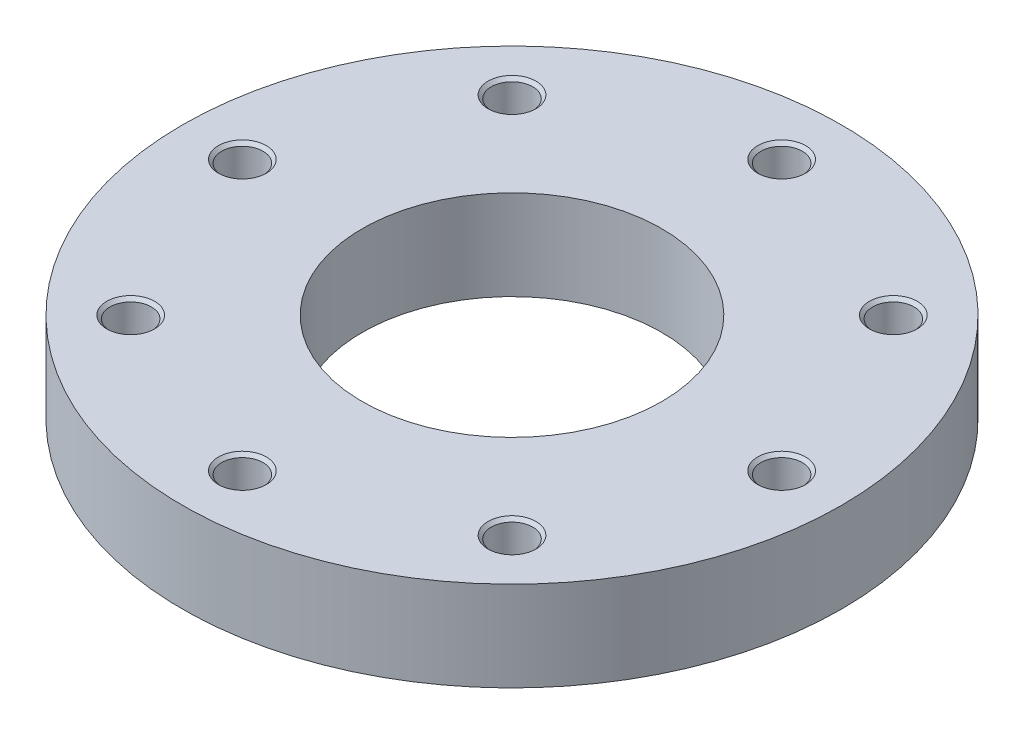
ISO-10303-21;
HEADER;
FILE_DESCRIPTION(('STEP AP214'),'2;1');
FILE_NAME('part.step','',(''),(''),'','','');
FILE_SCHEMA(('AUTOMOTIVE_DESIGN { 1 0 10303 214 1 1 1 1 }'));
ENDSEC;
DATA;
#1=APPLICATION_CONTEXT('core data for automotive mechanical design processes');
#2=APPLICATION_PROTOCOL_DEFINITION('international standard','automotive_design',2000,#1);
#3=PRODUCT_CONTEXT('',#1,'mechanical');
#4=PRODUCT('Part','Part','',(#3));
#5=PRODUCT_RELATED_PRODUCT_CATEGORY('part','',(#4));
#6=PRODUCT_DEFINITION_FORMATION('','',#4);
#7=PRODUCT_DEFINITION_CONTEXT('part definition',#1,'design');
#8=PRODUCT_DEFINITION('design','',#6,#7);
#9=PRODUCT_DEFINITION_SHAPE('','',#8);
#10=(LENGTH_UNIT() NAMED_UNIT(*) SI_UNIT(.MILLI.,.METRE.));
#11=(NAMED_UNIT(*) PLANE_ANGLE_UNIT() SI_UNIT($,.RADIAN.));
#12=(NAMED_UNIT(*) SI_UNIT($,.STERADIAN.) SOLID_ANGLE_UNIT());
#13=UNCERTAINTY_MEASURE_WITH_UNIT(LENGTH_MEASURE(1.E-05),#10,'distance_accuracy_value','');
#14=(GEOMETRIC_REPRESENTATION_CONTEXT(3) GLOBAL_UNCERTAINTY_ASSIGNED_CONTEXT((#13)) GLOBAL_UNIT_ASSIGNED_CONTEXT((#10,
#11,#12)) REPRESENTATION_CONTEXT('',''));
#15=CARTESIAN_POINT('',(0.,0.,0.));
#16=DIRECTION('',(0.,0.,1.));
#17=DIRECTION('',(1.,0.,0.));
#18=AXIS2_PLACEMENT_3D('',#15,#16,#17);
#19=CARTESIAN_POINT('',(0.,15.,0.));
#20=DIRECTION('',(0.,-1.,0.));
#21=DIRECTION('',(1.,0.,0.));
#22=AXIS2_PLACEMENT_3D('',#19,#20,#21);
#23=CYLINDRICAL_SURFACE('',#22,110.);
#24=CARTESIAN_POINT('',(0.,0.,0.));
#25=DIRECTION('',(0.,1.,0.));
#26=DIRECTION('',(1.,0.,0.));
#27=AXIS2_PLACEMENT_3D('',#24,#25,#26);
#28=CIRCLE('',#27,110.);
#29=CARTESIAN_POINT('',(110.,0.,0.));
#30=VERTEX_POINT('',#29);
#31=EDGE_CURVE('E9',#30,#30,#28,.T.);
#32=ORIENTED_EDGE('',*,*,#31,.T.);
#33=EDGE_LOOP('',(#32));
#34=FACE_BOUND('',#33,.T.);
#35=CARTESIAN_POINT('',(0.,30.,0.));
#36=DIRECTION('',(0.,1.,0.));
#37=DIRECTION('',(1.,0.,0.));
#38=AXIS2_PLACEMENT_3D('',#35,#36,#37);
#39=CIRCLE('',#38,110.);
#40=CARTESIAN_POINT('',(110.,30.,0.));
#41=VERTEX_POINT('',#40);
#42=EDGE_CURVE('E378',#41,#41,#39,.T.);
#43=ORIENTED_EDGE('',*,*,#42,.F.);
#44=EDGE_LOOP('',(#43));
#45=FACE_BOUND('',#44,.T.);
#46=ADVANCED_FACE('F15',(#34,#45),#23,.T.);
#47=CARTESIAN_POINT('',(80.,0.,0.));
#48=DIRECTION('',(0.,-1.,0.));
#49=DIRECTION('',(-1.,0.,0.));
#50=AXIS2_PLACEMENT_3D('',#47,#48,#49);
#51=PLANE('',#50);
#52=CARTESIAN_POINT('',(0.,0.,0.));
#53=DIRECTION('',(0.,1.,0.));
#54=DIRECTION('',(1.,0.,0.));
#55=AXIS2_PLACEMENT_3D('',#52,#53,#54);
#56=CIRCLE('',#55,50.);
#57=CARTESIAN_POINT('',(50.,0.,0.));
#58=VERTEX_POINT('',#57);
#59=EDGE_CURVE('E25',#58,#58,#56,.T.);
#60=ORIENTED_EDGE('',*,*,#59,.T.);
#61=EDGE_LOOP('',(#60));
#62=FACE_BOUND('',#61,.T.);
#63=ORIENTED_EDGE('',*,*,#31,.F.);
#64=EDGE_LOOP('',(#63));
#65=FACE_BOUND('',#64,.T.);
#66=ADVANCED_FACE('F226',(#62,#65),#51,.T.);
#67=CARTESIAN_POINT('',(0.,15.,0.));
#68=DIRECTION('',(0.,-1.,0.));
#69=DIRECTION('',(1.,0.,0.));
#70=AXIS2_PLACEMENT_3D('',#67,#68,#69);
#71=CYLINDRICAL_SURFACE('',#70,50.);
#72=CARTESIAN_POINT('',(0.,30.,0.));
#73=DIRECTION('',(0.,1.,0.));
#74=DIRECTION('',(1.,0.,0.));
#75=AXIS2_PLACEMENT_3D('',#72,#73,#74);
#76=CIRCLE('',#75,50.);
#77=CARTESIAN_POINT('',(50.,30.,0.));
#78=VERTEX_POINT('',#77);
#79=EDGE_CURVE('E380',#78,#78,#76,.T.);
#80=ORIENTED_EDGE('',*,*,#79,.T.);
#81=EDGE_LOOP('',(#80));
#82=FACE_BOUND('',#81,.T.);
#83=ORIENTED_EDGE('',*,*,#59,.F.);
#84=EDGE_LOOP('',(#83));
#85=FACE_BOUND('',#84,.T.);
#86=ADVANCED_FACE('F231',(#82,#85),#71,.F.);
#87=CARTESIAN_POINT('',(80.,30.,0.));
#88=DIRECTION('',(0.,1.,0.));
#89=DIRECTION('',(1.,0.,0.));
#90=AXIS2_PLACEMENT_3D('',#87,#88,#89);
#91=PLANE('',#90);
#92=ORIENTED_EDGE('',*,*,#42,.T.);
#93=EDGE_LOOP('',(#92));
#94=FACE_BOUND('',#93,.T.);
#95=ORIENTED_EDGE('',*,*,#79,.F.);
#96=EDGE_LOOP('',(#95));
#97=FACE_BOUND('',#96,.T.);
#98=CARTESIAN_POINT('',(90.,30.,0.));
#99=DIRECTION('',(0.,-1.,0.));
#100=DIRECTION('',(1.,0.,0.));
#101=AXIS2_PLACEMENT_3D('',#98,#99,#100);
#102=CIRCLE('',#101,8.);
#103=CARTESIAN_POINT('',(98.,30.,0.));
#104=VERTEX_POINT('',#103);
#105=EDGE_CURVE('E372',#104,#104,#102,.T.);
#106=ORIENTED_EDGE('',*,*,#105,.T.);
#107=EDGE_LOOP('',(#106));
#108=FACE_BOUND('',#107,.T.);
#109=CARTESIAN_POINT('',(63.6396103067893,30.,-63.6396103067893));
#110=DIRECTION('',(0.,-1.,0.));
#111=DIRECTION('',(0.707106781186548,0.,-0.707106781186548));
#112=AXIS2_PLACEMENT_3D('',#109,#110,#111);
#113=CIRCLE('',#112,8.);
#114=CARTESIAN_POINT('',(69.2964645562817,30.,-69.2964645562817));
#115=VERTEX_POINT('',#114);
#116=EDGE_CURVE('E355',#115,#115,#113,.T.);
#117=ORIENTED_EDGE('',*,*,#116,.T.);
#118=EDGE_LOOP('',(#117));
#119=FACE_BOUND('',#118,.T.);
#120=CARTESIAN_POINT('',(0.,30.,-90.));
#121=DIRECTION('',(0.,-1.,0.));
#122=DIRECTION('',(0.,0.,-1.));
#123=AXIS2_PLACEMENT_3D('',#120,#121,#122);
#124=CIRCLE('',#123,8.);
#125=CARTESIAN_POINT('',(0.,30.,-98.));
#126=VERTEX_POINT('',#125);
#127=EDGE_CURVE('E397',#126,#126,#124,.T.);
#128=ORIENTED_EDGE('',*,*,#127,.T.);
#129=EDGE_LOOP('',(#128));
#130=FACE_BOUND('',#129,.T.);
#131=CARTESIAN_POINT('',(-63.6396103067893,30.,-63.6396103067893));
#132=DIRECTION('',(0.,-1.,0.));
#133=DIRECTION('',(-0.707106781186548,0.,-0.707106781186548));
#134=AXIS2_PLACEMENT_3D('',#131,#132,#133);
#135=CIRCLE('',#134,8.);
#136=CARTESIAN_POINT('',(-69.2964645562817,30.,-69.2964645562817));
#137=VERTEX_POINT('',#136);
#138=EDGE_CURVE('E345',#137,#137,#135,.T.);
#139=ORIENTED_EDGE('',*,*,#138,.T.);
#140=EDGE_LOOP('',(#139));
#141=FACE_BOUND('',#140,.T.);
#142=CARTESIAN_POINT('',(-90.,30.,0.));
#143=DIRECTION('',(0.,-1.,0.));
#144=DIRECTION('',(-1.,0.,0.));
#145=AXIS2_PLACEMENT_3D('',#142,#143,#144);
#146=CIRCLE('',#145,8.);
#147=CARTESIAN_POINT('',(-98.,30.,0.));
#148=VERTEX_POINT('',#147);
#149=EDGE_CURVE('E349',#148,#148,#146,.T.);
#150=ORIENTED_EDGE('',*,*,#149,.T.);
#151=EDGE_LOOP('',(#150));
#152=FACE_BOUND('',#151,.T.);
#153=CARTESIAN_POINT('',(-63.6396103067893,30.,63.6396103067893));
#154=DIRECTION('',(0.,-1.,0.));
#155=DIRECTION('',(-0.707106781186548,0.,0.707106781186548));
#156=AXIS2_PLACEMENT_3D('',#153,#154,#155);
#157=CIRCLE('',#156,8.);
#158=CARTESIAN_POINT('',(-69.2964645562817,30.,69.2964645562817));
#159=VERTEX_POINT('',#158);
#160=EDGE_CURVE('E163',#159,#159,#157,.T.);
#161=ORIENTED_EDGE('',*,*,#160,.T.);
#162=EDGE_LOOP('',(#161));
#163=FACE_BOUND('',#162,.T.);
#164=CARTESIAN_POINT('',(0.,30.,90.));
#165=DIRECTION('',(0.,-1.,0.));
#166=DIRECTION('',(0.,0.,1.));
#167=AXIS2_PLACEMENT_3D('',#164,#165,#166);
#168=CIRCLE('',#167,8.);
#169=CARTESIAN_POINT('',(0.,30.,98.));
#170=VERTEX_POINT('',#169);
#171=EDGE_CURVE('E363',#170,#170,#168,.T.);
#172=ORIENTED_EDGE('',*,*,#171,.T.);
#173=EDGE_LOOP('',(#172));
#174=FACE_BOUND('',#173,.T.);
#175=CARTESIAN_POINT('',(63.6396103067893,30.,63.6396103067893));
#176=DIRECTION('',(0.,-1.,0.));
#177=DIRECTION('',(0.707106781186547,0.,0.707106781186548));
#178=AXIS2_PLACEMENT_3D('',#175,#176,#177);
#179=CIRCLE('',#178,8.);
#180=CARTESIAN_POINT('',(69.2964645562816,30.,69.2964645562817));
#181=VERTEX_POINT('',#180);
#182=EDGE_CURVE('E383',#181,#181,#179,.T.);
#183=ORIENTED_EDGE('',*,*,#182,.T.);
#184=EDGE_LOOP('',(#183));
#185=FACE_BOUND('',#184,.T.);
#186=ADVANCED_FACE('F241',(#94,#97,#108,#119,#130,#141,#152,#163,#174,#185),#91,.T.);
#187=CARTESIAN_POINT('',(90.,5.00308975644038,0.));
#188=DIRECTION('',(0.,1.,0.));
#189=DIRECTION('',(1.,0.,0.));
#190=AXIS2_PLACEMENT_3D('',#187,#188,#189);
#191=CONICAL_SURFACE('',#190,3.45875,1.0471975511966);
#192=CARTESIAN_POINT('',(90.,7.,0.));
#193=DIRECTION('',(0.,-1.,0.));
#194=DIRECTION('',(1.,0.,0.));
#195=AXIS2_PLACEMENT_3D('',#192,#193,#194);
#196=CIRCLE('',#195,6.9175);
#197=CARTESIAN_POINT('',(96.9175,7.,0.));
#198=VERTEX_POINT('',#197);
#199=EDGE_CURVE('E360',#198,#198,#196,.T.);
#200=ORIENTED_EDGE('',*,*,#199,.F.);
#201=EDGE_LOOP('',(#200));
#202=FACE_BOUND('',#201,.T.);
#203=CARTESIAN_POINT('',(90.,3.00617951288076,0.));
#204=VERTEX_POINT('',#203);
#205=VERTEX_LOOP('',#204);
#206=FACE_BOUND('',#205,.T.);
#207=ADVANCED_FACE('F284',(#202,#206),#191,.F.);
#208=CARTESIAN_POINT('',(90.,9.95875,0.));
#209=DIRECTION('',(0.,1.,0.));
#210=DIRECTION('',(1.,0.,0.));
#211=AXIS2_PLACEMENT_3D('',#208,#209,#210);
#212=CYLINDRICAL_SURFACE('',#211,6.9175);
#213=CARTESIAN_POINT('',(90.,12.9175,0.));
#214=DIRECTION('',(0.,-1.,0.));
#215=DIRECTION('',(1.,0.,0.));
#216=AXIS2_PLACEMENT_3D('',#213,#214,#215);
#217=CIRCLE('',#216,6.9175);
#218=CARTESIAN_POINT('',(96.9175,12.9175,0.));
#219=VERTEX_POINT('',#218);
#220=EDGE_CURVE('E359',#219,#219,#217,.T.);
#221=ORIENTED_EDGE('',*,*,#220,.F.);
#222=EDGE_LOOP('',(#221));
#223=FACE_BOUND('',#222,.T.);
#224=ORIENTED_EDGE('',*,*,#199,.T.);
#225=EDGE_LOOP('',(#224));
#226=FACE_BOUND('',#225,.T.);
#227=ADVANCED_FACE('F280',(#223,#226),#212,.F.);
#228=CARTESIAN_POINT('',(90.,13.45875,0.));
#229=DIRECTION('',(0.,1.,0.));
#230=DIRECTION('',(1.,0.,0.));
#231=AXIS2_PLACEMENT_3D('',#228,#229,#230);
#232=CONICAL_SURFACE('',#231,7.45875,0.785398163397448);
#233=CARTESIAN_POINT('',(90.,14.,0.));
#234=DIRECTION('',(0.,-1.,0.));
#235=DIRECTION('',(1.,0.,0.));
#236=AXIS2_PLACEMENT_3D('',#233,#234,#235);
#237=CIRCLE('',#236,8.);
#238=CARTESIAN_POINT('',(98.,14.,0.));
#239=VERTEX_POINT('',#238);
#240=EDGE_CURVE('E361',#239,#239,#237,.T.);
#241=ORIENTED_EDGE('',*,*,#240,.F.);
#242=EDGE_LOOP('',(#241));
#243=FACE_BOUND('',#242,.T.);
#244=ORIENTED_EDGE('',*,*,#220,.T.);
#245=EDGE_LOOP('',(#244));
#246=FACE_BOUND('',#245,.T.);
#247=ADVANCED_FACE('F283',(#243,#246),#232,.F.);
#248=CARTESIAN_POINT('',(97.45875,14.,0.));
#249=DIRECTION('',(0.,1.,0.));
#250=DIRECTION('',(-1.,0.,0.));
#251=AXIS2_PLACEMENT_3D('',#248,#249,#250);
#252=PLANE('',#251);
#253=CARTESIAN_POINT('',(90.,14.,0.));
#254=DIRECTION('',(0.,-1.,0.));
#255=DIRECTION('',(1.,0.,0.));
#256=AXIS2_PLACEMENT_3D('',#253,#254,#255);
#257=CIRCLE('',#256,6.9175);
#258=CARTESIAN_POINT('',(96.9175,14.,0.));
#259=VERTEX_POINT('',#258);
#260=EDGE_CURVE('E374',#259,#259,#257,.T.);
#261=ORIENTED_EDGE('',*,*,#260,.F.);
#262=EDGE_LOOP('',(#261));
#263=FACE_BOUND('',#262,.T.);
#264=ORIENTED_EDGE('',*,*,#240,.T.);
#265=EDGE_LOOP('',(#264));
#266=FACE_BOUND('',#265,.T.);
#267=ADVANCED_FACE('F305',(#263,#266),#252,.F.);
#268=CARTESIAN_POINT('',(90.,21.45875,0.));
#269=DIRECTION('',(0.,1.,0.));
#270=DIRECTION('',(1.,0.,0.));
#271=AXIS2_PLACEMENT_3D('',#268,#269,#270);
#272=CYLINDRICAL_SURFACE('',#271,6.9175);
#273=CARTESIAN_POINT('',(90.,28.9175,0.));
#274=DIRECTION('',(0.,-1.,0.));
#275=DIRECTION('',(1.,0.,0.));
#276=AXIS2_PLACEMENT_3D('',#273,#274,#275);
#277=CIRCLE('',#276,6.9175);
#278=CARTESIAN_POINT('',(96.9175,28.9175,0.));
#279=VERTEX_POINT('',#278);
#280=EDGE_CURVE('E375',#279,#279,#277,.T.);
#281=ORIENTED_EDGE('',*,*,#280,.F.);
#282=EDGE_LOOP('',(#281));
#283=FACE_BOUND('',#282,.T.);
#284=ORIENTED_EDGE('',*,*,#260,.T.);
#285=EDGE_LOOP('',(#284));
#286=FACE_BOUND('',#285,.T.);
#287=ADVANCED_FACE('F301',(#283,#286),#272,.F.);
#288=CARTESIAN_POINT('',(90.,29.45875,0.));
#289=DIRECTION('',(0.,1.,0.));
#290=DIRECTION('',(1.,0.,0.));
#291=AXIS2_PLACEMENT_3D('',#288,#289,#290);
#292=CONICAL_SURFACE('',#291,7.45875,0.785398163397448);
#293=ORIENTED_EDGE('',*,*,#105,.F.);
#294=EDGE_LOOP('',(#293));
#295=FACE_BOUND('',#294,.T.);
#296=ORIENTED_EDGE('',*,*,#280,.T.);
#297=EDGE_LOOP('',(#296));
#298=FACE_BOUND('',#297,.T.);
#299=ADVANCED_FACE('F304',(#295,#298),#292,.F.);
#300=CARTESIAN_POINT('',(63.6396103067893,5.00308975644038,-63.6396103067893));
#301=DIRECTION('',(0.,1.,0.));
#302=DIRECTION('',(0.707106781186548,0.,-0.707106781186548));
#303=AXIS2_PLACEMENT_3D('',#300,#301,#302);
#304=CONICAL_SURFACE('',#303,3.45875,1.0471975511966);
#305=CARTESIAN_POINT('',(63.6396103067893,7.,-63.6396103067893));
#306=DIRECTION('',(0.,-1.,0.));
#307=DIRECTION('',(0.707106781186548,0.,-0.707106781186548));
#308=AXIS2_PLACEMENT_3D('',#305,#306,#307);
#309=CIRCLE('',#308,6.9175);
#310=CARTESIAN_POINT('',(68.5310214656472,7.,-68.5310214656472));
#311=VERTEX_POINT('',#310);
#312=EDGE_CURVE('E412',#311,#311,#309,.T.);
#313=ORIENTED_EDGE('',*,*,#312,.F.);
#314=EDGE_LOOP('',(#313));
#315=FACE_BOUND('',#314,.T.);
#316=CARTESIAN_POINT('',(63.6396103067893,3.00617951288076,-63.6396103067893));
#317=VERTEX_POINT('',#316);
#318=VERTEX_LOOP('',#317);
#319=FACE_BOUND('',#318,.T.);
#320=ADVANCED_FACE('F237',(#315,#319),#304,.F.);
#321=CARTESIAN_POINT('',(63.6396103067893,9.95875,-63.6396103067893));
#322=DIRECTION('',(0.,1.,0.));
#323=DIRECTION('',(0.707106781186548,0.,-0.707106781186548));
#324=AXIS2_PLACEMENT_3D('',#321,#322,#323);
#325=CYLINDRICAL_SURFACE('',#324,6.9175);
#326=CARTESIAN_POINT('',(63.6396103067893,12.9175,-63.6396103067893));
#327=DIRECTION('',(0.,-1.,0.));
#328=DIRECTION('',(0.707106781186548,0.,-0.707106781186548));
#329=AXIS2_PLACEMENT_3D('',#326,#327,#328);
#330=CIRCLE('',#329,6.9175);
#331=CARTESIAN_POINT('',(68.5310214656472,12.9175,-68.5310214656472));
#332=VERTEX_POINT('',#331);
#333=EDGE_CURVE('E410',#332,#332,#330,.T.);
#334=ORIENTED_EDGE('',*,*,#333,.F.);
#335=EDGE_LOOP('',(#334));
#336=FACE_BOUND('',#335,.T.);
#337=ORIENTED_EDGE('',*,*,#312,.T.);
#338=EDGE_LOOP('',(#337));
#339=FACE_BOUND('',#338,.T.);
#340=ADVANCED_FACE('F317',(#336,#339),#325,.F.);
#341=CARTESIAN_POINT('',(63.6396103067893,13.45875,-63.6396103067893));
#342=DIRECTION('',(0.,1.,0.));
#343=DIRECTION('',(0.707106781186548,0.,-0.707106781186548));
#344=AXIS2_PLACEMENT_3D('',#341,#342,#343);
#345=CONICAL_SURFACE('',#344,7.45875,0.785398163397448);
#346=CARTESIAN_POINT('',(63.6396103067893,14.,-63.6396103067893));
#347=DIRECTION('',(0.,-1.,0.));
#348=DIRECTION('',(0.707106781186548,0.,-0.707106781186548));
#349=AXIS2_PLACEMENT_3D('',#346,#347,#348);
#350=CIRCLE('',#349,8.);
#351=CARTESIAN_POINT('',(69.2964645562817,14.,-69.2964645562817));
#352=VERTEX_POINT('',#351);
#353=EDGE_CURVE('E413',#352,#352,#350,.T.);
#354=ORIENTED_EDGE('',*,*,#353,.F.);
#355=EDGE_LOOP('',(#354));
#356=FACE_BOUND('',#355,.T.);
#357=ORIENTED_EDGE('',*,*,#333,.T.);
#358=EDGE_LOOP('',(#357));
#359=FACE_BOUND('',#358,.T.);
#360=ADVANCED_FACE('F315',(#356,#359),#345,.F.);
#361=CARTESIAN_POINT('',(68.9137430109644,14.,-68.9137430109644));
#362=DIRECTION('',(0.,1.,0.));
#363=DIRECTION('',(-0.707106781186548,0.,0.707106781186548));
#364=AXIS2_PLACEMENT_3D('',#361,#362,#363);
#365=PLANE('',#364);
#366=CARTESIAN_POINT('',(63.6396103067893,14.,-63.6396103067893));
#367=DIRECTION('',(0.,-1.,0.));
#368=DIRECTION('',(0.707106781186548,0.,-0.707106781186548));
#369=AXIS2_PLACEMENT_3D('',#366,#367,#368);
#370=CIRCLE('',#369,6.9175);
#371=CARTESIAN_POINT('',(68.5310214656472,14.,-68.5310214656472));
#372=VERTEX_POINT('',#371);
#373=EDGE_CURVE('E357',#372,#372,#370,.T.);
#374=ORIENTED_EDGE('',*,*,#373,.F.);
#375=EDGE_LOOP('',(#374));
#376=FACE_BOUND('',#375,.T.);
#377=ORIENTED_EDGE('',*,*,#353,.T.);
#378=EDGE_LOOP('',(#377));
#379=FACE_BOUND('',#378,.T.);
#380=ADVANCED_FACE('F253',(#376,#379),#365,.F.);
#381=CARTESIAN_POINT('',(63.6396103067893,21.45875,-63.6396103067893));
#382=DIRECTION('',(0.,1.,0.));
#383=DIRECTION('',(0.707106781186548,0.,-0.707106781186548));
#384=AXIS2_PLACEMENT_3D('',#381,#382,#383);
#385=CYLINDRICAL_SURFACE('',#384,6.9175);
#386=CARTESIAN_POINT('',(63.6396103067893,28.9175,-63.6396103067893));
#387=DIRECTION('',(0.,-1.,0.));
#388=DIRECTION('',(0.707106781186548,0.,-0.707106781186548));
#389=AXIS2_PLACEMENT_3D('',#386,#387,#388);
#390=CIRCLE('',#389,6.9175);
#391=CARTESIAN_POINT('',(68.5310214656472,28.9175,-68.5310214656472));
#392=VERTEX_POINT('',#391);
#393=EDGE_CURVE('E358',#392,#392,#390,.T.);
#394=ORIENTED_EDGE('',*,*,#393,.F.);
#395=EDGE_LOOP('',(#394));
#396=FACE_BOUND('',#395,.T.);
#397=ORIENTED_EDGE('',*,*,#373,.T.);
#398=EDGE_LOOP('',(#397));
#399=FACE_BOUND('',#398,.T.);
#400=ADVANCED_FACE('F249',(#396,#399),#385,.F.);
#401=CARTESIAN_POINT('',(63.6396103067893,29.45875,-63.6396103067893));
#402=DIRECTION('',(0.,1.,0.));
#403=DIRECTION('',(0.707106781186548,0.,-0.707106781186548));
#404=AXIS2_PLACEMENT_3D('',#401,#402,#403);
#405=CONICAL_SURFACE('',#404,7.45875,0.785398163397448);
#406=ORIENTED_EDGE('',*,*,#116,.F.);
#407=EDGE_LOOP('',(#406));
#408=FACE_BOUND('',#407,.T.);
#409=ORIENTED_EDGE('',*,*,#393,.T.);
#410=EDGE_LOOP('',(#409));
#411=FACE_BOUND('',#410,.T.);
#412=ADVANCED_FACE('F252',(#408,#411),#405,.F.);
#413=CARTESIAN_POINT('',(0.,5.00308975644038,-90.));
#414=DIRECTION('',(0.,1.,0.));
#415=DIRECTION('',(0.,0.,-1.));
#416=AXIS2_PLACEMENT_3D('',#413,#414,#415);
#417=CONICAL_SURFACE('',#416,3.45875,1.0471975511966);
#418=CARTESIAN_POINT('',(0.,7.,-90.));
#419=DIRECTION('',(0.,-1.,0.));
#420=DIRECTION('',(0.,0.,-1.));
#421=AXIS2_PLACEMENT_3D('',#418,#419,#420);
#422=CIRCLE('',#421,6.9175);
#423=CARTESIAN_POINT('',(0.,7.,-96.9175));
#424=VERTEX_POINT('',#423);
#425=EDGE_CURVE('E409',#424,#424,#422,.T.);
#426=ORIENTED_EDGE('',*,*,#425,.F.);
#427=EDGE_LOOP('',(#426));
#428=FACE_BOUND('',#427,.T.);
#429=CARTESIAN_POINT('',(0.,3.00617951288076,-90.));
#430=VERTEX_POINT('',#429);
#431=VERTEX_LOOP('',#430);
#432=FACE_BOUND('',#431,.T.);
#433=ADVANCED_FACE('F296',(#428,#432),#417,.F.);
#434=CARTESIAN_POINT('',(0.,9.95875,-90.));
#435=DIRECTION('',(0.,1.,0.));
#436=DIRECTION('',(0.,0.,-1.));
#437=AXIS2_PLACEMENT_3D('',#434,#435,#436);
#438=CYLINDRICAL_SURFACE('',#437,6.9175);
#439=CARTESIAN_POINT('',(0.,12.9175,-90.));
#440=DIRECTION('',(0.,-1.,0.));
#441=DIRECTION('',(0.,0.,-1.));
#442=AXIS2_PLACEMENT_3D('',#439,#440,#441);
#443=CIRCLE('',#442,6.9175);
#444=CARTESIAN_POINT('',(0.,12.9175,-96.9175));
#445=VERTEX_POINT('',#444);
#446=EDGE_CURVE('E400',#445,#445,#443,.T.);
#447=ORIENTED_EDGE('',*,*,#446,.F.);
#448=EDGE_LOOP('',(#447));
#449=FACE_BOUND('',#448,.T.);
#450=ORIENTED_EDGE('',*,*,#425,.T.);
#451=EDGE_LOOP('',(#450));
#452=FACE_BOUND('',#451,.T.);
#453=ADVANCED_FACE('F299',(#449,#452),#438,.F.);
#454=CARTESIAN_POINT('',(0.,13.45875,-90.));
#455=DIRECTION('',(0.,1.,0.));
#456=DIRECTION('',(0.,0.,-1.));
#457=AXIS2_PLACEMENT_3D('',#454,#455,#456);
#458=CONICAL_SURFACE('',#457,7.45875,0.785398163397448);
#459=CARTESIAN_POINT('',(0.,14.,-90.));
#460=DIRECTION('',(0.,-1.,0.));
#461=DIRECTION('',(0.,0.,-1.));
#462=AXIS2_PLACEMENT_3D('',#459,#460,#461);
#463=CIRCLE('',#462,8.);
#464=CARTESIAN_POINT('',(0.,14.,-98.));
#465=VERTEX_POINT('',#464);
#466=EDGE_CURVE('E399',#465,#465,#463,.T.);
#467=ORIENTED_EDGE('',*,*,#466,.F.);
#468=EDGE_LOOP('',(#467));
#469=FACE_BOUND('',#468,.T.);
#470=ORIENTED_EDGE('',*,*,#446,.T.);
#471=EDGE_LOOP('',(#470));
#472=FACE_BOUND('',#471,.T.);
#473=ADVANCED_FACE('F465',(#469,#472),#458,.F.);
#474=CARTESIAN_POINT('',(0.,14.,-97.45875));
#475=DIRECTION('',(0.,1.,0.));
#476=DIRECTION('',(0.,0.,1.));
#477=AXIS2_PLACEMENT_3D('',#474,#475,#476);
#478=PLANE('',#477);
#479=CARTESIAN_POINT('',(0.,14.,-90.));
#480=DIRECTION('',(0.,-1.,0.));
#481=DIRECTION('',(0.,0.,-1.));
#482=AXIS2_PLACEMENT_3D('',#479,#480,#481);
#483=CIRCLE('',#482,6.9175);
#484=CARTESIAN_POINT('',(0.,14.,-96.9175));
#485=VERTEX_POINT('',#484);
#486=EDGE_CURVE('E401',#485,#485,#483,.T.);
#487=ORIENTED_EDGE('',*,*,#486,.F.);
#488=EDGE_LOOP('',(#487));
#489=FACE_BOUND('',#488,.T.);
#490=ORIENTED_EDGE('',*,*,#466,.T.);
#491=EDGE_LOOP('',(#490));
#492=FACE_BOUND('',#491,.T.);
#493=ADVANCED_FACE('F471',(#489,#492),#478,.F.);
#494=CARTESIAN_POINT('',(0.,21.45875,-90.));
#495=DIRECTION('',(0.,1.,0.));
#496=DIRECTION('',(0.,0.,-1.));
#497=AXIS2_PLACEMENT_3D('',#494,#495,#496);
#498=CYLINDRICAL_SURFACE('',#497,6.9175);
#499=CARTESIAN_POINT('',(0.,28.9175,-90.));
#500=DIRECTION('',(0.,-1.,0.));
#501=DIRECTION('',(0.,0.,-1.));
#502=AXIS2_PLACEMENT_3D('',#499,#500,#501);
#503=CIRCLE('',#502,6.9175);
#504=CARTESIAN_POINT('',(0.,28.9175,-96.9175));
#505=VERTEX_POINT('',#504);
#506=EDGE_CURVE('E394',#505,#505,#503,.T.);
#507=ORIENTED_EDGE('',*,*,#506,.F.);
#508=EDGE_LOOP('',(#507));
#509=FACE_BOUND('',#508,.T.);
#510=ORIENTED_EDGE('',*,*,#486,.T.);
#511=EDGE_LOOP('',(#510));
#512=FACE_BOUND('',#511,.T.);
#513=ADVANCED_FACE('F490',(#509,#512),#498,.F.);
#514=CARTESIAN_POINT('',(0.,29.45875,-90.));
#515=DIRECTION('',(0.,1.,0.));
#516=DIRECTION('',(0.,0.,-1.));
#517=AXIS2_PLACEMENT_3D('',#514,#515,#516);
#518=CONICAL_SURFACE('',#517,7.45875,0.785398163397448);
#519=ORIENTED_EDGE('',*,*,#127,.F.);
#520=EDGE_LOOP('',(#519));
#521=FACE_BOUND('',#520,.T.);
#522=ORIENTED_EDGE('',*,*,#506,.T.);
#523=EDGE_LOOP('',(#522));
#524=FACE_BOUND('',#523,.T.);
#525=ADVANCED_FACE('F481',(#521,#524),#518,.F.);
#526=CARTESIAN_POINT('',(-63.6396103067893,5.00308975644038,-63.6396103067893));
#527=DIRECTION('',(0.,1.,0.));
#528=DIRECTION('',(-0.707106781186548,0.,-0.707106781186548));
#529=AXIS2_PLACEMENT_3D('',#526,#527,#528);
#530=CONICAL_SURFACE('',#529,3.45875,1.0471975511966);
#531=CARTESIAN_POINT('',(-63.6396103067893,7.,-63.6396103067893));
#532=DIRECTION('',(0.,-1.,0.));
#533=DIRECTION('',(-0.707106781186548,0.,-0.707106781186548));
#534=AXIS2_PLACEMENT_3D('',#531,#532,#533);
#535=CIRCLE('',#534,6.9175);
#536=CARTESIAN_POINT('',(-68.5310214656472,7.,-68.5310214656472));
#537=VERTEX_POINT('',#536);
#538=EDGE_CURVE('E343',#537,#537,#535,.T.);
#539=ORIENTED_EDGE('',*,*,#538,.F.);
#540=EDGE_LOOP('',(#539));
#541=FACE_BOUND('',#540,.T.);
#542=CARTESIAN_POINT('',(-63.6396103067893,3.00617951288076,-63.6396103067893));
#543=VERTEX_POINT('',#542);
#544=VERTEX_LOOP('',#543);
#545=FACE_BOUND('',#544,.T.);
#546=ADVANCED_FACE('F478',(#541,#545),#530,.F.);
#547=CARTESIAN_POINT('',(-63.6396103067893,9.95875,-63.6396103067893));
#548=DIRECTION('',(0.,1.,0.));
#549=DIRECTION('',(-0.707106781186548,0.,-0.707106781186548));
#550=AXIS2_PLACEMENT_3D('',#547,#548,#549);
#551=CYLINDRICAL_SURFACE('',#550,6.9175);
#552=CARTESIAN_POINT('',(-63.6396103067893,12.9175,-63.6396103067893));
#553=DIRECTION('',(0.,-1.,0.));
#554=DIRECTION('',(-0.707106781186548,0.,-0.707106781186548));
#555=AXIS2_PLACEMENT_3D('',#552,#553,#554);
#556=CIRCLE('',#555,6.9175);
#557=CARTESIAN_POINT('',(-68.5310214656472,12.9175,-68.5310214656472));
#558=VERTEX_POINT('',#557);
#559=EDGE_CURVE('E341',#558,#558,#556,.T.);
#560=ORIENTED_EDGE('',*,*,#559,.F.);
#561=EDGE_LOOP('',(#560));
#562=FACE_BOUND('',#561,.T.);
#563=ORIENTED_EDGE('',*,*,#538,.T.);
#564=EDGE_LOOP('',(#563));
#565=FACE_BOUND('',#564,.T.);
#566=ADVANCED_FACE('F334',(#562,#565),#551,.F.);
#567=CARTESIAN_POINT('',(-63.6396103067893,13.45875,-63.6396103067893));
#568=DIRECTION('',(0.,1.,0.));
#569=DIRECTION('',(-0.707106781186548,0.,-0.707106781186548));
#570=AXIS2_PLACEMENT_3D('',#567,#568,#569);
#571=CONICAL_SURFACE('',#570,7.45875,0.785398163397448);
#572=CARTESIAN_POINT('',(-63.6396103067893,14.,-63.6396103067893));
#573=DIRECTION('',(0.,-1.,0.));
#574=DIRECTION('',(-0.707106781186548,0.,-0.707106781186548));
#575=AXIS2_PLACEMENT_3D('',#572,#573,#574);
#576=CIRCLE('',#575,8.);
#577=CARTESIAN_POINT('',(-69.2964645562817,14.,-69.2964645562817));
#578=VERTEX_POINT('',#577);
#579=EDGE_CURVE('E340',#578,#578,#576,.T.);
#580=ORIENTED_EDGE('',*,*,#579,.F.);
#581=EDGE_LOOP('',(#580));
#582=FACE_BOUND('',#581,.T.);
#583=ORIENTED_EDGE('',*,*,#559,.T.);
#584=EDGE_LOOP('',(#583));
#585=FACE_BOUND('',#584,.T.);
#586=ADVANCED_FACE('F17',(#582,#585),#571,.F.);
#587=CARTESIAN_POINT('',(-68.9137430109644,14.,-68.9137430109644));
#588=DIRECTION('',(0.,1.,0.));
#589=DIRECTION('',(0.707106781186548,0.,0.707106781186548));
#590=AXIS2_PLACEMENT_3D('',#587,#588,#589);
#591=PLANE('',#590);
#592=CARTESIAN_POINT('',(-63.6396103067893,14.,-63.6396103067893));
#593=DIRECTION('',(0.,-1.,0.));
#594=DIRECTION('',(-0.707106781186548,0.,-0.707106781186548));
#595=AXIS2_PLACEMENT_3D('',#592,#593,#594);
#596=CIRCLE('',#595,6.9175);
#597=CARTESIAN_POINT('',(-68.5310214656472,14.,-68.5310214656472));
#598=VERTEX_POINT('',#597);
#599=EDGE_CURVE('E338',#598,#598,#596,.T.);
#600=ORIENTED_EDGE('',*,*,#599,.F.);
#601=EDGE_LOOP('',(#600));
#602=FACE_BOUND('',#601,.T.);
#603=ORIENTED_EDGE('',*,*,#579,.T.);
#604=EDGE_LOOP('',(#603));
#605=FACE_BOUND('',#604,.T.);
#606=ADVANCED_FACE('F325',(#602,#605),#591,.F.);
#607=CARTESIAN_POINT('',(-63.6396103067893,21.45875,-63.6396103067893));
#608=DIRECTION('',(0.,1.,0.));
#609=DIRECTION('',(-0.707106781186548,0.,-0.707106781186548));
#610=AXIS2_PLACEMENT_3D('',#607,#608,#609);
#611=CYLINDRICAL_SURFACE('',#610,6.9175);
#612=CARTESIAN_POINT('',(-63.6396103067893,28.9175,-63.6396103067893));
#613=DIRECTION('',(0.,-1.,0.));
#614=DIRECTION('',(-0.707106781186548,0.,-0.707106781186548));
#615=AXIS2_PLACEMENT_3D('',#612,#613,#614);
#616=CIRCLE('',#615,6.9175);
#617=CARTESIAN_POINT('',(-68.5310214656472,28.9175,-68.5310214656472));
#618=VERTEX_POINT('',#617);
#619=EDGE_CURVE('E377',#618,#618,#616,.T.);
#620=ORIENTED_EDGE('',*,*,#619,.F.);
#621=EDGE_LOOP('',(#620));
#622=FACE_BOUND('',#621,.T.);
#623=ORIENTED_EDGE('',*,*,#599,.T.);
#624=EDGE_LOOP('',(#623));
#625=FACE_BOUND('',#624,.T.);
#626=ADVANCED_FACE('F219',(#622,#625),#611,.F.);
#627=CARTESIAN_POINT('',(-63.6396103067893,29.45875,-63.6396103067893));
#628=DIRECTION('',(0.,1.,0.));
#629=DIRECTION('',(-0.707106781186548,0.,-0.707106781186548));
#630=AXIS2_PLACEMENT_3D('',#627,#628,#629);
#631=CONICAL_SURFACE('',#630,7.45875,0.785398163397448);
#632=ORIENTED_EDGE('',*,*,#138,.F.);
#633=EDGE_LOOP('',(#632));
#634=FACE_BOUND('',#633,.T.);
#635=ORIENTED_EDGE('',*,*,#619,.T.);
#636=EDGE_LOOP('',(#635));
#637=FACE_BOUND('',#636,.T.);
#638=ADVANCED_FACE('F208',(#634,#637),#631,.F.);
#639=CARTESIAN_POINT('',(-90.,5.00308975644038,0.));
#640=DIRECTION('',(0.,1.,0.));
#641=DIRECTION('',(-1.,0.,0.));
#642=AXIS2_PLACEMENT_3D('',#639,#640,#641);
#643=CONICAL_SURFACE('',#642,3.45875,1.0471975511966);
#644=CARTESIAN_POINT('',(-90.,7.,0.));
#645=DIRECTION('',(0.,-1.,0.));
#646=DIRECTION('',(-1.,0.,0.));
#647=AXIS2_PLACEMENT_3D('',#644,#645,#646);
#648=CIRCLE('',#647,6.9175);
#649=CARTESIAN_POINT('',(-96.9175,7.,0.));
#650=VERTEX_POINT('',#649);
#651=EDGE_CURVE('E353',#650,#650,#648,.T.);
#652=ORIENTED_EDGE('',*,*,#651,.F.);
#653=EDGE_LOOP('',(#652));
#654=FACE_BOUND('',#653,.T.);
#655=CARTESIAN_POINT('',(-90.,3.00617951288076,0.));
#656=VERTEX_POINT('',#655);
#657=VERTEX_LOOP('',#656);
#658=FACE_BOUND('',#657,.T.);
#659=ADVANCED_FACE('F205',(#654,#658),#643,.F.);
#660=CARTESIAN_POINT('',(-90.,9.95875,0.));
#661=DIRECTION('',(0.,1.,0.));
#662=DIRECTION('',(-1.,0.,0.));
#663=AXIS2_PLACEMENT_3D('',#660,#661,#662);
#664=CYLINDRICAL_SURFACE('',#663,6.9175);
#665=CARTESIAN_POINT('',(-90.,12.9175,0.));
#666=DIRECTION('',(0.,-1.,0.));
#667=DIRECTION('',(-1.,0.,0.));
#668=AXIS2_PLACEMENT_3D('',#665,#666,#667);
#669=CIRCLE('',#668,6.9175);
#670=CARTESIAN_POINT('',(-96.9175,12.9175,0.));
#671=VERTEX_POINT('',#670);
#672=EDGE_CURVE('E351',#671,#671,#669,.T.);
#673=ORIENTED_EDGE('',*,*,#672,.F.);
#674=EDGE_LOOP('',(#673));
#675=FACE_BOUND('',#674,.T.);
#676=ORIENTED_EDGE('',*,*,#651,.T.);
#677=EDGE_LOOP('',(#676));
#678=FACE_BOUND('',#677,.T.);
#679=ADVANCED_FACE('F207',(#675,#678),#664,.F.);
#680=CARTESIAN_POINT('',(-90.,13.45875,0.));
#681=DIRECTION('',(0.,1.,0.));
#682=DIRECTION('',(-1.,0.,0.));
#683=AXIS2_PLACEMENT_3D('',#680,#681,#682);
#684=CONICAL_SURFACE('',#683,7.45875,0.785398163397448);
#685=CARTESIAN_POINT('',(-90.,14.,0.));
#686=DIRECTION('',(0.,-1.,0.));
#687=DIRECTION('',(-1.,0.,0.));
#688=AXIS2_PLACEMENT_3D('',#685,#686,#687);
#689=CIRCLE('',#688,8.);
#690=CARTESIAN_POINT('',(-98.,14.,0.));
#691=VERTEX_POINT('',#690);
#692=EDGE_CURVE('E354',#691,#691,#689,.T.);
#693=ORIENTED_EDGE('',*,*,#692,.F.);
#694=EDGE_LOOP('',(#693));
#695=FACE_BOUND('',#694,.T.);
#696=ORIENTED_EDGE('',*,*,#672,.T.);
#697=EDGE_LOOP('',(#696));
#698=FACE_BOUND('',#697,.T.);
#699=ADVANCED_FACE('F216',(#695,#698),#684,.F.);
#700=CARTESIAN_POINT('',(-97.45875,14.,0.));
#701=DIRECTION('',(0.,1.,0.));
#702=DIRECTION('',(1.,0.,0.));
#703=AXIS2_PLACEMENT_3D('',#700,#701,#702);
#704=PLANE('',#703);
#705=CARTESIAN_POINT('',(-90.,14.,0.));
#706=DIRECTION('',(0.,-1.,0.));
#707=DIRECTION('',(-1.,0.,0.));
#708=AXIS2_PLACEMENT_3D('',#705,#706,#707);
#709=CIRCLE('',#708,6.9175);
#710=CARTESIAN_POINT('',(-96.9175,14.,0.));
#711=VERTEX_POINT('',#710);
#712=EDGE_CURVE('E370',#711,#711,#709,.T.);
#713=ORIENTED_EDGE('',*,*,#712,.F.);
#714=EDGE_LOOP('',(#713));
#715=FACE_BOUND('',#714,.T.);
#716=ORIENTED_EDGE('',*,*,#692,.T.);
#717=EDGE_LOOP('',(#716));
#718=FACE_BOUND('',#717,.T.);
#719=ADVANCED_FACE('F278',(#715,#718),#704,.F.);
#720=CARTESIAN_POINT('',(-90.,21.45875,0.));
#721=DIRECTION('',(0.,1.,0.));
#722=DIRECTION('',(-1.,0.,0.));
#723=AXIS2_PLACEMENT_3D('',#720,#721,#722);
#724=CYLINDRICAL_SURFACE('',#723,6.9175);
#725=CARTESIAN_POINT('',(-90.,28.9175,0.));
#726=DIRECTION('',(0.,-1.,0.));
#727=DIRECTION('',(-1.,0.,0.));
#728=AXIS2_PLACEMENT_3D('',#725,#726,#727);
#729=CIRCLE('',#728,6.9175);
#730=CARTESIAN_POINT('',(-96.9175,28.9175,0.));
#731=VERTEX_POINT('',#730);
#732=EDGE_CURVE('E368',#731,#731,#729,.T.);
#733=ORIENTED_EDGE('',*,*,#732,.F.);
#734=EDGE_LOOP('',(#733));
#735=FACE_BOUND('',#734,.T.);
#736=ORIENTED_EDGE('',*,*,#712,.T.);
#737=EDGE_LOOP('',(#736));
#738=FACE_BOUND('',#737,.T.);
#739=ADVANCED_FACE('F247',(#735,#738),#724,.F.);
#740=CARTESIAN_POINT('',(-90.,29.45875,0.));
#741=DIRECTION('',(0.,1.,0.));
#742=DIRECTION('',(-1.,0.,0.));
#743=AXIS2_PLACEMENT_3D('',#740,#741,#742);
#744=CONICAL_SURFACE('',#743,7.45875,0.785398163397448);
#745=ORIENTED_EDGE('',*,*,#149,.F.);
#746=EDGE_LOOP('',(#745));
#747=FACE_BOUND('',#746,.T.);
#748=ORIENTED_EDGE('',*,*,#732,.T.);
#749=EDGE_LOOP('',(#748));
#750=FACE_BOUND('',#749,.T.);
#751=ADVANCED_FACE('F243',(#747,#750),#744,.F.);
#752=CARTESIAN_POINT('',(-63.6396103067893,5.00308975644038,63.6396103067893));
#753=DIRECTION('',(0.,1.,0.));
#754=DIRECTION('',(-0.707106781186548,0.,0.707106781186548));
#755=AXIS2_PLACEMENT_3D('',#752,#753,#754);
#756=CONICAL_SURFACE('',#755,3.45875,1.0471975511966);
#757=CARTESIAN_POINT('',(-63.6396103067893,7.,63.6396103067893));
#758=DIRECTION('',(0.,-1.,0.));
#759=DIRECTION('',(-0.707106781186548,0.,0.707106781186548));
#760=AXIS2_PLACEMENT_3D('',#757,#758,#759);
#761=CIRCLE('',#760,6.9175);
#762=CARTESIAN_POINT('',(-68.5310214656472,7.,68.5310214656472));
#763=VERTEX_POINT('',#762);
#764=EDGE_CURVE('E366',#763,#763,#761,.T.);
#765=ORIENTED_EDGE('',*,*,#764,.F.);
#766=EDGE_LOOP('',(#765));
#767=FACE_BOUND('',#766,.T.);
#768=CARTESIAN_POINT('',(-63.6396103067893,3.00617951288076,63.6396103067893));
#769=VERTEX_POINT('',#768);
#770=VERTEX_LOOP('',#769);
#771=FACE_BOUND('',#770,.T.);
#772=ADVANCED_FACE('F246',(#767,#771),#756,.F.);
#773=CARTESIAN_POINT('',(-63.6396103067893,9.95875,63.6396103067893));
#774=DIRECTION('',(0.,1.,0.));
#775=DIRECTION('',(-0.707106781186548,0.,0.707106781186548));
#776=AXIS2_PLACEMENT_3D('',#773,#774,#775);
#777=CYLINDRICAL_SURFACE('',#776,6.9175);
#778=CARTESIAN_POINT('',(-63.6396103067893,12.9175,63.6396103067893));
#779=DIRECTION('',(0.,-1.,0.));
#780=DIRECTION('',(-0.707106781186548,0.,0.707106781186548));
#781=AXIS2_PLACEMENT_3D('',#778,#779,#780);
#782=CIRCLE('',#781,6.9175);
#783=CARTESIAN_POINT('',(-68.5310214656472,12.9175,68.5310214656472));
#784=VERTEX_POINT('',#783);
#785=EDGE_CURVE('E369',#784,#784,#782,.T.);
#786=ORIENTED_EDGE('',*,*,#785,.F.);
#787=EDGE_LOOP('',(#786));
#788=FACE_BOUND('',#787,.T.);
#789=ORIENTED_EDGE('',*,*,#764,.T.);
#790=EDGE_LOOP('',(#789));
#791=FACE_BOUND('',#790,.T.);
#792=ADVANCED_FACE('F262',(#788,#791),#777,.F.);
#793=CARTESIAN_POINT('',(-63.6396103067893,13.45875,63.6396103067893));
#794=DIRECTION('',(0.,1.,0.));
#795=DIRECTION('',(-0.707106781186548,0.,0.707106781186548));
#796=AXIS2_PLACEMENT_3D('',#793,#794,#795);
#797=CONICAL_SURFACE('',#796,7.45875,0.785398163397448);
#798=CARTESIAN_POINT('',(-63.6396103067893,14.,63.6396103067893));
#799=DIRECTION('',(0.,-1.,0.));
#800=DIRECTION('',(-0.707106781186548,0.,0.707106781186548));
#801=AXIS2_PLACEMENT_3D('',#798,#799,#800);
#802=CIRCLE('',#801,8.);
#803=CARTESIAN_POINT('',(-69.2964645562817,14.,69.2964645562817));
#804=VERTEX_POINT('',#803);
#805=EDGE_CURVE('E387',#804,#804,#802,.T.);
#806=ORIENTED_EDGE('',*,*,#805,.F.);
#807=EDGE_LOOP('',(#806));
#808=FACE_BOUND('',#807,.T.);
#809=ORIENTED_EDGE('',*,*,#785,.T.);
#810=EDGE_LOOP('',(#809));
#811=FACE_BOUND('',#810,.T.);
#812=ADVANCED_FACE('F271',(#808,#811),#797,.F.);
#813=CARTESIAN_POINT('',(-68.9137430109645,14.,68.9137430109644));
#814=DIRECTION('',(0.,1.,0.));
#815=DIRECTION('',(0.707106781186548,0.,-0.707106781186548));
#816=AXIS2_PLACEMENT_3D('',#813,#814,#815);
#817=PLANE('',#816);
#818=CARTESIAN_POINT('',(-63.6396103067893,14.,63.6396103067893));
#819=DIRECTION('',(0.,-1.,0.));
#820=DIRECTION('',(-0.707106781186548,0.,0.707106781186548));
#821=AXIS2_PLACEMENT_3D('',#818,#819,#820);
#822=CIRCLE('',#821,6.9175);
#823=CARTESIAN_POINT('',(-68.5310214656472,14.,68.5310214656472));
#824=VERTEX_POINT('',#823);
#825=EDGE_CURVE('E389',#824,#824,#822,.T.);
#826=ORIENTED_EDGE('',*,*,#825,.F.);
#827=EDGE_LOOP('',(#826));
#828=FACE_BOUND('',#827,.T.);
#829=ORIENTED_EDGE('',*,*,#805,.T.);
#830=EDGE_LOOP('',(#829));
#831=FACE_BOUND('',#830,.T.);
#832=ADVANCED_FACE('F274',(#828,#831),#817,.F.);
#833=CARTESIAN_POINT('',(-63.6396103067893,21.45875,63.6396103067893));
#834=DIRECTION('',(0.,1.,0.));
#835=DIRECTION('',(-0.707106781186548,0.,0.707106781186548));
#836=AXIS2_PLACEMENT_3D('',#833,#834,#835);
#837=CYLINDRICAL_SURFACE('',#836,6.9175);
#838=CARTESIAN_POINT('',(-63.6396103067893,28.9175,63.6396103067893));
#839=DIRECTION('',(0.,-1.,0.));
#840=DIRECTION('',(-0.707106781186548,0.,0.707106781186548));
#841=AXIS2_PLACEMENT_3D('',#838,#839,#840);
#842=CIRCLE('',#841,6.9175);
#843=CARTESIAN_POINT('',(-68.5310214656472,28.9175,68.5310214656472));
#844=VERTEX_POINT('',#843);
#845=EDGE_CURVE('E170',#844,#844,#842,.T.);
#846=ORIENTED_EDGE('',*,*,#845,.F.);
#847=EDGE_LOOP('',(#846));
#848=FACE_BOUND('',#847,.T.);
#849=ORIENTED_EDGE('',*,*,#825,.T.);
#850=EDGE_LOOP('',(#849));
#851=FACE_BOUND('',#850,.T.);
#852=ADVANCED_FACE('F309',(#848,#851),#837,.F.);
#853=CARTESIAN_POINT('',(-63.6396103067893,29.45875,63.6396103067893));
#854=DIRECTION('',(0.,1.,0.));
#855=DIRECTION('',(-0.707106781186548,0.,0.707106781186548));
#856=AXIS2_PLACEMENT_3D('',#853,#854,#855);
#857=CONICAL_SURFACE('',#856,7.45875,0.785398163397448);
#858=ORIENTED_EDGE('',*,*,#160,.F.);
#859=EDGE_LOOP('',(#858));
#860=FACE_BOUND('',#859,.T.);
#861=ORIENTED_EDGE('',*,*,#845,.T.);
#862=EDGE_LOOP('',(#861));
#863=FACE_BOUND('',#862,.T.);
#864=ADVANCED_FACE('F269',(#860,#863),#857,.F.);
#865=CARTESIAN_POINT('',(0.,5.00308975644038,90.));
#866=DIRECTION('',(0.,1.,0.));
#867=DIRECTION('',(0.,0.,1.));
#868=AXIS2_PLACEMENT_3D('',#865,#866,#867);
#869=CONICAL_SURFACE('',#868,3.45875,1.0471975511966);
#870=CARTESIAN_POINT('',(0.,7.,90.));
#871=DIRECTION('',(0.,-1.,0.));
#872=DIRECTION('',(0.,0.,1.));
#873=AXIS2_PLACEMENT_3D('',#870,#871,#872);
#874=CIRCLE('',#873,6.9175);
#875=CARTESIAN_POINT('',(0.,7.,96.9175));
#876=VERTEX_POINT('',#875);
#877=EDGE_CURVE('E403',#876,#876,#874,.T.);
#878=ORIENTED_EDGE('',*,*,#877,.F.);
#879=EDGE_LOOP('',(#878));
#880=FACE_BOUND('',#879,.T.);
#881=CARTESIAN_POINT('',(0.,3.00617951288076,90.));
#882=VERTEX_POINT('',#881);
#883=VERTEX_LOOP('',#882);
#884=FACE_BOUND('',#883,.T.);
#885=ADVANCED_FACE('F265',(#880,#884),#869,.F.);
#886=CARTESIAN_POINT('',(0.,9.95875,90.));
#887=DIRECTION('',(0.,1.,0.));
#888=DIRECTION('',(0.,0.,1.));
#889=AXIS2_PLACEMENT_3D('',#886,#887,#888);
#890=CYLINDRICAL_SURFACE('',#889,6.9175);
#891=CARTESIAN_POINT('',(0.,12.9175,90.));
#892=DIRECTION('',(0.,-1.,0.));
#893=DIRECTION('',(0.,0.,1.));
#894=AXIS2_PLACEMENT_3D('',#891,#892,#893);
#895=CIRCLE('',#894,6.9175);
#896=CARTESIAN_POINT('',(0.,12.9175,96.9175));
#897=VERTEX_POINT('',#896);
#898=EDGE_CURVE('E405',#897,#897,#895,.T.);
#899=ORIENTED_EDGE('',*,*,#898,.F.);
#900=EDGE_LOOP('',(#899));
#901=FACE_BOUND('',#900,.T.);
#902=ORIENTED_EDGE('',*,*,#877,.T.);
#903=EDGE_LOOP('',(#902));
#904=FACE_BOUND('',#903,.T.);
#905=ADVANCED_FACE('F268',(#901,#904),#890,.F.);
#906=CARTESIAN_POINT('',(0.,13.45875,90.));
#907=DIRECTION('',(0.,1.,0.));
#908=DIRECTION('',(0.,0.,1.));
#909=AXIS2_PLACEMENT_3D('',#906,#907,#908);
#910=CONICAL_SURFACE('',#909,7.45875,0.785398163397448);
#911=CARTESIAN_POINT('',(0.,14.,90.));
#912=DIRECTION('',(0.,-1.,0.));
#913=DIRECTION('',(0.,0.,1.));
#914=AXIS2_PLACEMENT_3D('',#911,#912,#913);
#915=CIRCLE('',#914,8.);
#916=CARTESIAN_POINT('',(0.,14.,98.));
#917=VERTEX_POINT('',#916);
#918=EDGE_CURVE('E386',#917,#917,#915,.T.);
#919=ORIENTED_EDGE('',*,*,#918,.F.);
#920=EDGE_LOOP('',(#919));
#921=FACE_BOUND('',#920,.T.);
#922=ORIENTED_EDGE('',*,*,#898,.T.);
#923=EDGE_LOOP('',(#922));
#924=FACE_BOUND('',#923,.T.);
#925=ADVANCED_FACE('F512',(#921,#924),#910,.F.);
#926=CARTESIAN_POINT('',(0.,14.,97.45875));
#927=DIRECTION('',(0.,1.,0.));
#928=DIRECTION('',(0.,0.,-1.));
#929=AXIS2_PLACEMENT_3D('',#926,#927,#928);
#930=PLANE('',#929);
#931=CARTESIAN_POINT('',(0.,14.,90.));
#932=DIRECTION('',(0.,-1.,0.));
#933=DIRECTION('',(0.,0.,1.));
#934=AXIS2_PLACEMENT_3D('',#931,#932,#933);
#935=CIRCLE('',#934,6.9175);
#936=CARTESIAN_POINT('',(0.,14.,96.9175));
#937=VERTEX_POINT('',#936);
#938=EDGE_CURVE('E365',#937,#937,#935,.T.);
#939=ORIENTED_EDGE('',*,*,#938,.F.);
#940=EDGE_LOOP('',(#939));
#941=FACE_BOUND('',#940,.T.);
#942=ORIENTED_EDGE('',*,*,#918,.T.);
#943=EDGE_LOOP('',(#942));
#944=FACE_BOUND('',#943,.T.);
#945=ADVANCED_FACE('F288',(#941,#944),#930,.F.);
#946=CARTESIAN_POINT('',(0.,21.45875,90.));
#947=DIRECTION('',(0.,1.,0.));
#948=DIRECTION('',(0.,0.,1.));
#949=AXIS2_PLACEMENT_3D('',#946,#947,#948);
#950=CYLINDRICAL_SURFACE('',#949,6.9175);
#951=CARTESIAN_POINT('',(0.,28.9175,90.));
#952=DIRECTION('',(0.,-1.,0.));
#953=DIRECTION('',(0.,0.,1.));
#954=AXIS2_PLACEMENT_3D('',#951,#952,#953);
#955=CIRCLE('',#954,6.9175);
#956=CARTESIAN_POINT('',(0.,28.9175,96.9175));
#957=VERTEX_POINT('',#956);
#958=EDGE_CURVE('E19',#957,#957,#955,.T.);
#959=ORIENTED_EDGE('',*,*,#958,.F.);
#960=EDGE_LOOP('',(#959));
#961=FACE_BOUND('',#960,.T.);
#962=ORIENTED_EDGE('',*,*,#938,.T.);
#963=EDGE_LOOP('',(#962));
#964=FACE_BOUND('',#963,.T.);
#965=ADVANCED_FACE('F259',(#961,#964),#950,.F.);
#966=CARTESIAN_POINT('',(0.,29.45875,90.));
#967=DIRECTION('',(0.,1.,0.));
#968=DIRECTION('',(0.,0.,1.));
#969=AXIS2_PLACEMENT_3D('',#966,#967,#968);
#970=CONICAL_SURFACE('',#969,7.45875,0.785398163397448);
#971=ORIENTED_EDGE('',*,*,#171,.F.);
#972=EDGE_LOOP('',(#971));
#973=FACE_BOUND('',#972,.T.);
#974=ORIENTED_EDGE('',*,*,#958,.T.);
#975=EDGE_LOOP('',(#974));
#976=FACE_BOUND('',#975,.T.);
#977=ADVANCED_FACE('F255',(#973,#976),#970,.F.);
#978=CARTESIAN_POINT('',(63.6396103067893,5.00308975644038,63.6396103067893));
#979=DIRECTION('',(0.,1.,0.));
#980=DIRECTION('',(0.707106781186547,0.,0.707106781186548));
#981=AXIS2_PLACEMENT_3D('',#978,#979,#980);
#982=CONICAL_SURFACE('',#981,3.45875,1.0471975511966);
#983=CARTESIAN_POINT('',(63.6396103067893,7.,63.6396103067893));
#984=DIRECTION('',(0.,-1.,0.));
#985=DIRECTION('',(0.707106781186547,0.,0.707106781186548));
#986=AXIS2_PLACEMENT_3D('',#983,#984,#985);
#987=CIRCLE('',#986,6.9175);
#988=CARTESIAN_POINT('',(68.5310214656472,7.,68.5310214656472));
#989=VERTEX_POINT('',#988);
#990=EDGE_CURVE('E421',#989,#989,#987,.T.);
#991=ORIENTED_EDGE('',*,*,#990,.F.);
#992=EDGE_LOOP('',(#991));
#993=FACE_BOUND('',#992,.T.);
#994=CARTESIAN_POINT('',(63.6396103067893,3.00617951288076,63.6396103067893));
#995=VERTEX_POINT('',#994);
#996=VERTEX_LOOP('',#995);
#997=FACE_BOUND('',#996,.T.);
#998=ADVANCED_FACE('F258',(#993,#997),#982,.F.);
#999=CARTESIAN_POINT('',(63.6396103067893,9.95875,63.6396103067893));
#1000=DIRECTION('',(0.,1.,0.));
#1001=DIRECTION('',(0.707106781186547,0.,0.707106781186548));
#1002=AXIS2_PLACEMENT_3D('',#999,#1000,#1001);
#1003=CYLINDRICAL_SURFACE('',#1002,6.9175);
#1004=CARTESIAN_POINT('',(63.6396103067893,12.9175,63.6396103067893));
#1005=DIRECTION('',(0.,-1.,0.));
#1006=DIRECTION('',(0.707106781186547,0.,0.707106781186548));
#1007=AXIS2_PLACEMENT_3D('',#1004,#1005,#1006);
#1008=CIRCLE('',#1007,6.9175);
#1009=CARTESIAN_POINT('',(68.5310214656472,12.9175,68.5310214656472));
#1010=VERTEX_POINT('',#1009);
#1011=EDGE_CURVE('E417',#1010,#1010,#1008,.T.);
#1012=ORIENTED_EDGE('',*,*,#1011,.F.);
#1013=EDGE_LOOP('',(#1012));
#1014=FACE_BOUND('',#1013,.T.);
#1015=ORIENTED_EDGE('',*,*,#990,.T.);
#1016=EDGE_LOOP('',(#1015));
#1017=FACE_BOUND('',#1016,.T.);
#1018=ADVANCED_FACE('F448',(#1014,#1017),#1003,.F.);
#1019=CARTESIAN_POINT('',(63.6396103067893,13.45875,63.6396103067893));
#1020=DIRECTION('',(0.,1.,0.));
#1021=DIRECTION('',(0.707106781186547,0.,0.707106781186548));
#1022=AXIS2_PLACEMENT_3D('',#1019,#1020,#1021);
#1023=CONICAL_SURFACE('',#1022,7.45875,0.785398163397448);
#1024=CARTESIAN_POINT('',(63.6396103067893,14.,63.6396103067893));
#1025=DIRECTION('',(0.,-1.,0.));
#1026=DIRECTION('',(0.707106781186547,0.,0.707106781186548));
#1027=AXIS2_PLACEMENT_3D('',#1024,#1025,#1026);
#1028=CIRCLE('',#1027,8.);
#1029=CARTESIAN_POINT('',(69.2964645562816,14.,69.2964645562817));
#1030=VERTEX_POINT('',#1029);
#1031=EDGE_CURVE('E392',#1030,#1030,#1028,.T.);
#1032=ORIENTED_EDGE('',*,*,#1031,.F.);
#1033=EDGE_LOOP('',(#1032));
#1034=FACE_BOUND('',#1033,.T.);
#1035=ORIENTED_EDGE('',*,*,#1011,.T.);
#1036=EDGE_LOOP('',(#1035));
#1037=FACE_BOUND('',#1036,.T.);
#1038=ADVANCED_FACE('F313',(#1034,#1037),#1023,.F.);
#1039=CARTESIAN_POINT('',(68.9137430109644,14.,68.9137430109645));
#1040=DIRECTION('',(0.,1.,0.));
#1041=DIRECTION('',(-0.707106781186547,0.,-0.707106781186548));
#1042=AXIS2_PLACEMENT_3D('',#1039,#1040,#1041);
#1043=PLANE('',#1042);
#1044=CARTESIAN_POINT('',(63.6396103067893,14.,63.6396103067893));
#1045=DIRECTION('',(0.,-1.,0.));
#1046=DIRECTION('',(0.707106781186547,0.,0.707106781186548));
#1047=AXIS2_PLACEMENT_3D('',#1044,#1045,#1046);
#1048=CIRCLE('',#1047,6.9175);
#1049=CARTESIAN_POINT('',(68.5310214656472,14.,68.5310214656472));
#1050=VERTEX_POINT('',#1049);
#1051=EDGE_CURVE('E390',#1050,#1050,#1048,.T.);
#1052=ORIENTED_EDGE('',*,*,#1051,.F.);
#1053=EDGE_LOOP('',(#1052));
#1054=FACE_BOUND('',#1053,.T.);
#1055=ORIENTED_EDGE('',*,*,#1031,.T.);
#1056=EDGE_LOOP('',(#1055));
#1057=FACE_BOUND('',#1056,.T.);
#1058=ADVANCED_FACE('F294',(#1054,#1057),#1043,.F.);
#1059=CARTESIAN_POINT('',(63.6396103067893,21.45875,63.6396103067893));
#1060=DIRECTION('',(0.,1.,0.));
#1061=DIRECTION('',(0.707106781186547,0.,0.707106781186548));
#1062=AXIS2_PLACEMENT_3D('',#1059,#1060,#1061);
#1063=CYLINDRICAL_SURFACE('',#1062,6.9175);
#1064=CARTESIAN_POINT('',(63.6396103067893,28.9175,63.6396103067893));
#1065=DIRECTION('',(0.,-1.,0.));
#1066=DIRECTION('',(0.707106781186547,0.,0.707106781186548));
#1067=AXIS2_PLACEMENT_3D('',#1064,#1065,#1066);
#1068=CIRCLE('',#1067,6.9175);
#1069=CARTESIAN_POINT('',(68.5310214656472,28.9175,68.5310214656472));
#1070=VERTEX_POINT('',#1069);
#1071=EDGE_CURVE('E381',#1070,#1070,#1068,.T.);
#1072=ORIENTED_EDGE('',*,*,#1071,.F.);
#1073=EDGE_LOOP('',(#1072));
#1074=FACE_BOUND('',#1073,.T.);
#1075=ORIENTED_EDGE('',*,*,#1051,.T.);
#1076=EDGE_LOOP('',(#1075));
#1077=FACE_BOUND('',#1076,.T.);
#1078=ADVANCED_FACE('F290',(#1074,#1077),#1063,.F.);
#1079=CARTESIAN_POINT('',(63.6396103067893,29.45875,63.6396103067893));
#1080=DIRECTION('',(0.,1.,0.));
#1081=DIRECTION('',(0.707106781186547,0.,0.707106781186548));
#1082=AXIS2_PLACEMENT_3D('',#1079,#1080,#1081);
#1083=CONICAL_SURFACE('',#1082,7.45875,0.785398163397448);
#1084=ORIENTED_EDGE('',*,*,#182,.F.);
#1085=EDGE_LOOP('',(#1084));
#1086=FACE_BOUND('',#1085,.T.);
#1087=ORIENTED_EDGE('',*,*,#1071,.T.);
#1088=EDGE_LOOP('',(#1087));
#1089=FACE_BOUND('',#1088,.T.);
#1090=ADVANCED_FACE('F293',(#1086,#1089),#1083,.F.);
#1091=CLOSED_SHELL('',(#46,#66,#86,#186,#207,#227,#247,#267,#287,#299,#320,#340,#360,#380,#400,
#412,#433,#453,#473,#493,#513,#525,#546,#566,#586,#606,#626,#638,#659,#679,#699,#719,#739,#751,
#772,#792,#812,#832,#852,#864,#885,#905,#925,#945,#965,#977,#998,#1018,#1038,#1058,#1078,#1090));
#1092=MANIFOLD_SOLID_BREP('B1',#1091);
#1093=ADVANCED_BREP_SHAPE_REPRESENTATION('',(#18,#1092),#14);
#1094=SHAPE_DEFINITION_REPRESENTATION(#9,#1093);
ENDSEC;
END-ISO-10303-21;
